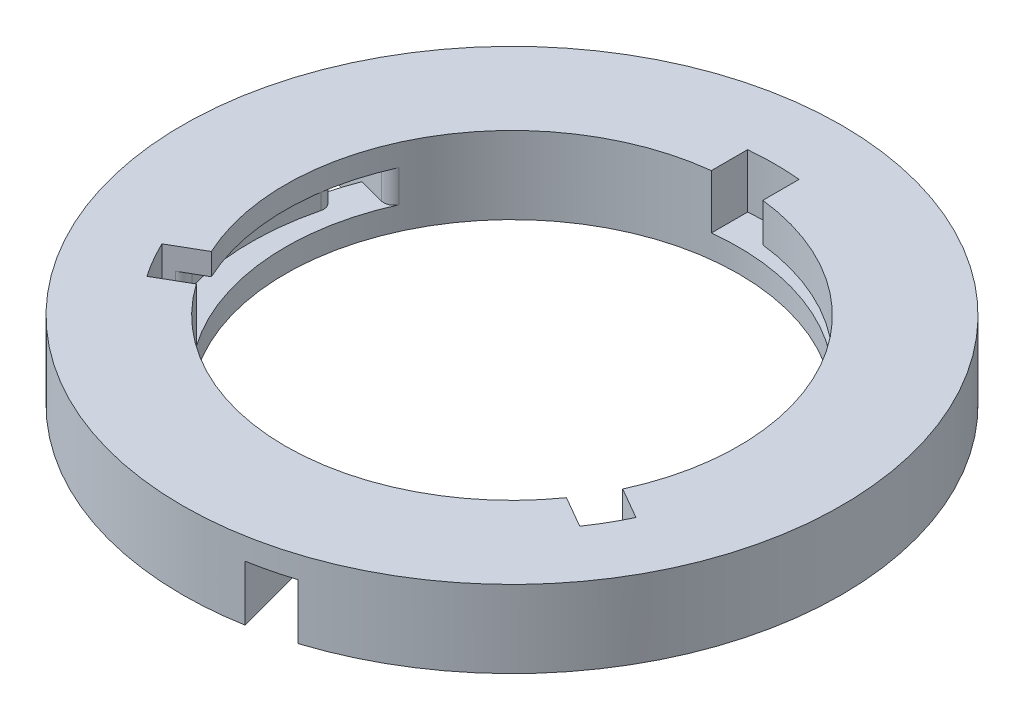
ISO-10303-21;
HEADER;
FILE_DESCRIPTION(('STEP AP214'),'2;1');
FILE_NAME('part.step','',(''),(''),'','','');
FILE_SCHEMA(('AUTOMOTIVE_DESIGN { 1 0 10303 214 1 1 1 1 }'));
ENDSEC;
DATA;
#1=APPLICATION_CONTEXT('core data for automotive mechanical design processes');
#2=APPLICATION_PROTOCOL_DEFINITION('international standard','automotive_design',2000,#1);
#3=PRODUCT_CONTEXT('',#1,'mechanical');
#4=PRODUCT('Part','Part','',(#3));
#5=PRODUCT_RELATED_PRODUCT_CATEGORY('part','',(#4));
#6=PRODUCT_DEFINITION_FORMATION('','',#4);
#7=PRODUCT_DEFINITION_CONTEXT('part definition',#1,'design');
#8=PRODUCT_DEFINITION('design','',#6,#7);
#9=PRODUCT_DEFINITION_SHAPE('','',#8);
#10=(LENGTH_UNIT() NAMED_UNIT(*) SI_UNIT(.MILLI.,.METRE.));
#11=(NAMED_UNIT(*) PLANE_ANGLE_UNIT() SI_UNIT($,.RADIAN.));
#12=(NAMED_UNIT(*) SI_UNIT($,.STERADIAN.) SOLID_ANGLE_UNIT());
#13=UNCERTAINTY_MEASURE_WITH_UNIT(LENGTH_MEASURE(1.E-05),#10,'distance_accuracy_value','');
#14=(GEOMETRIC_REPRESENTATION_CONTEXT(3) GLOBAL_UNCERTAINTY_ASSIGNED_CONTEXT((#13)) GLOBAL_UNIT_ASSIGNED_CONTEXT((#10,
#11,#12)) REPRESENTATION_CONTEXT('',''));
#15=CARTESIAN_POINT('',(0.,0.,0.));
#16=DIRECTION('',(0.,0.,1.));
#17=DIRECTION('',(1.,0.,0.));
#18=AXIS2_PLACEMENT_3D('',#15,#16,#17);
#19=CARTESIAN_POINT('',(0.,40.3076120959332,0.));
#20=DIRECTION('',(0.,1.,0.));
#21=DIRECTION('',(0.,0.,1.));
#22=AXIS2_PLACEMENT_3D('',#19,#20,#21);
#23=CYLINDRICAL_SURFACE('',#22,64.);
#24=CARTESIAN_POINT('',(0.,15.,0.));
#25=DIRECTION('',(0.,1.,0.));
#26=DIRECTION('',(0.,0.,1.));
#27=AXIS2_PLACEMENT_3D('',#24,#25,#26);
#28=CIRCLE('',#27,64.);
#29=CARTESIAN_POINT('',(0.,15.,64.));
#30=VERTEX_POINT('',#29);
#31=EDGE_CURVE('E310',#30,#30,#28,.T.);
#32=ORIENTED_EDGE('',*,*,#31,.F.);
#33=EDGE_LOOP('',(#32));
#34=FACE_BOUND('',#33,.T.);
#35=DIRECTION('',(0.,1.,0.));
#36=VECTOR('',#35,1.);
#37=CARTESIAN_POINT('',(-62.5277560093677,-0.000999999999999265,-13.6484331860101));
#38=LINE('',#37,#36);
#39=CARTESIAN_POINT('',(-62.5277560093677,0.,-13.6484331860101));
#40=VERTEX_POINT('',#39);
#41=CARTESIAN_POINT('',(-62.5277560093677,10.75,-13.6484331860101));
#42=VERTEX_POINT('',#41);
#43=EDGE_CURVE('E285',#40,#42,#38,.T.);
#44=ORIENTED_EDGE('',*,*,#43,.F.);
#45=CARTESIAN_POINT('',(0.,0.,0.));
#46=DIRECTION('',(0.,1.,0.));
#47=DIRECTION('',(0.,0.,1.));
#48=AXIS2_PLACEMENT_3D('',#45,#46,#47);
#49=CIRCLE('',#48,64.);
#50=CARTESIAN_POINT('',(11.1905472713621,0.,63.0140591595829));
#51=VERTEX_POINT('',#50);
#52=EDGE_CURVE('E71',#40,#51,#49,.T.);
#53=ORIENTED_EDGE('',*,*,#52,.T.);
#54=DIRECTION('',(0.,1.,0.));
#55=VECTOR('',#54,1.);
#56=CARTESIAN_POINT('',(11.1905472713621,-0.000999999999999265,63.0140591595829));
#57=LINE('',#56,#55);
#58=CARTESIAN_POINT('',(11.1905472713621,10.75,63.0140591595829));
#59=VERTEX_POINT('',#58);
#60=EDGE_CURVE('E664',#51,#59,#57,.T.);
#61=ORIENTED_EDGE('',*,*,#60,.T.);
#62=CARTESIAN_POINT('',(0.,10.75,0.));
#63=DIRECTION('',(0.,-1.,0.));
#64=DIRECTION('',(0.,0.,-1.));
#65=AXIS2_PLACEMENT_3D('',#62,#63,#64);
#66=CIRCLE('',#65,64.);
#67=CARTESIAN_POINT('',(19.4439881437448,10.75,60.9748417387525));
#68=VERTEX_POINT('',#67);
#69=EDGE_CURVE('E665',#68,#59,#66,.T.);
#70=ORIENTED_EDGE('',*,*,#69,.F.);
#71=DIRECTION('',(0.,1.,0.));
#72=VECTOR('',#71,1.);
#73=CARTESIAN_POINT('',(19.4439881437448,-0.000999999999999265,60.9748417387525));
#74=LINE('',#73,#72);
#75=CARTESIAN_POINT('',(19.4439881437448,0.,60.9748417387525));
#76=VERTEX_POINT('',#75);
#77=EDGE_CURVE('E669',#76,#68,#74,.T.);
#78=ORIENTED_EDGE('',*,*,#77,.F.);
#79=CARTESIAN_POINT('',(-60.1670496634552,0.,-21.8157313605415));
#80=VERTEX_POINT('',#79);
#81=EDGE_CURVE('E304',#76,#80,#49,.T.);
#82=ORIENTED_EDGE('',*,*,#81,.T.);
#83=DIRECTION('',(0.,1.,0.));
#84=VECTOR('',#83,1.);
#85=CARTESIAN_POINT('',(-60.1670496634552,-0.000999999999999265,-21.8157313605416));
#86=LINE('',#85,#84);
#87=CARTESIAN_POINT('',(-60.1670496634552,10.75,-21.8157313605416));
#88=VERTEX_POINT('',#87);
#89=EDGE_CURVE('E63',#80,#88,#86,.T.);
#90=ORIENTED_EDGE('',*,*,#89,.T.);
#91=CARTESIAN_POINT('',(0.,10.75,0.));
#92=DIRECTION('',(0.,-1.,0.));
#93=DIRECTION('',(0.866025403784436,0.,0.500000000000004));
#94=AXIS2_PLACEMENT_3D('',#91,#92,#93);
#95=CIRCLE('',#94,64.);
#96=EDGE_CURVE('E292',#42,#88,#95,.T.);
#97=ORIENTED_EDGE('',*,*,#96,.F.);
#98=EDGE_LOOP('',(#44,#53,#61,#70,#78,#82,#90,#97));
#99=FACE_BOUND('',#98,.T.);
#100=ADVANCED_FACE('F47',(#34,#99),#23,.T.);
#101=CARTESIAN_POINT('',(44.,0.,0.));
#102=DIRECTION('',(0.,1.,0.));
#103=DIRECTION('',(0.,0.,1.));
#104=AXIS2_PLACEMENT_3D('',#101,#102,#103);
#105=PLANE('',#104);
#106=CARTESIAN_POINT('',(0.,0.,0.));
#107=DIRECTION('',(0.,1.,0.));
#108=DIRECTION('',(0.,0.,1.));
#109=AXIS2_PLACEMENT_3D('',#106,#107,#108);
#110=CIRCLE('',#109,44.);
#111=CARTESIAN_POINT('',(0.,0.,44.));
#112=VERTEX_POINT('',#111);
#113=EDGE_CURVE('E305',#112,#112,#110,.T.);
#114=ORIENTED_EDGE('',*,*,#113,.T.);
#115=EDGE_LOOP('',(#114));
#116=FACE_BOUND('',#115,.T.);
#117=DIRECTION('',(0.965925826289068,0.,0.258819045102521));
#118=VECTOR('',#117,1.);
#119=CARTESIAN_POINT('',(-62.5277560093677,0.,-13.6484331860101));
#120=LINE('',#119,#118);
#121=CARTESIAN_POINT('',(-49.9533716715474,0.,-10.2791370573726));
#122=VERTEX_POINT('',#121);
#123=EDGE_CURVE('E283',#40,#122,#120,.T.);
#124=ORIENTED_EDGE('',*,*,#123,.T.);
#125=CARTESIAN_POINT('',(0.,0.,0.));
#126=DIRECTION('',(0.,1.,0.));
#127=DIRECTION('',(0.,0.,1.));
#128=AXIS2_PLACEMENT_3D('',#125,#126,#127);
#129=CIRCLE('',#128,51.);
#130=CARTESIAN_POINT('',(-47.5514113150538,0.,-18.4353812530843));
#131=VERTEX_POINT('',#130);
#132=EDGE_CURVE('E293',#122,#131,#129,.F.);
#133=ORIENTED_EDGE('',*,*,#132,.T.);
#134=DIRECTION('',(-0.965925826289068,0.,-0.258819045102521));
#135=VECTOR('',#134,1.);
#136=CARTESIAN_POINT('',(-47.5514113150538,0.,-18.4353812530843));
#137=LINE('',#136,#135);
#138=EDGE_CURVE('E744',#131,#80,#137,.T.);
#139=ORIENTED_EDGE('',*,*,#138,.T.);
#140=ORIENTED_EDGE('',*,*,#81,.F.);
#141=DIRECTION('',(-0.258819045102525,0.,-0.965925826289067));
#142=VECTOR('',#141,1.);
#143=CARTESIAN_POINT('',(19.4439881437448,0.,60.9748417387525));
#144=LINE('',#143,#142);
#145=CARTESIAN_POINT('',(16.0746920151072,0.,48.4004574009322));
#146=VERTEX_POINT('',#145);
#147=EDGE_CURVE('E671',#76,#146,#144,.T.);
#148=ORIENTED_EDGE('',*,*,#147,.T.);
#149=CARTESIAN_POINT('',(0.,0.,0.));
#150=DIRECTION('',(0.,1.,0.));
#151=DIRECTION('',(0.,0.,1.));
#152=AXIS2_PLACEMENT_3D('',#149,#150,#151);
#153=CIRCLE('',#152,51.);
#154=CARTESIAN_POINT('',(7.81019716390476,0.,50.3984208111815));
#155=VERTEX_POINT('',#154);
#156=EDGE_CURVE('E747',#146,#155,#153,.F.);
#157=ORIENTED_EDGE('',*,*,#156,.T.);
#158=DIRECTION('',(0.258819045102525,0.,0.965925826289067));
#159=VECTOR('',#158,1.);
#160=CARTESIAN_POINT('',(7.81019716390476,0.,50.3984208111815));
#161=LINE('',#160,#159);
#162=EDGE_CURVE('E302',#155,#51,#161,.T.);
#163=ORIENTED_EDGE('',*,*,#162,.T.);
#164=ORIENTED_EDGE('',*,*,#52,.F.);
#165=EDGE_LOOP('',(#124,#133,#139,#140,#148,#157,#163,#164));
#166=FACE_BOUND('',#165,.T.);
#167=ADVANCED_FACE('F300',(#116,#166),#105,.F.);
#168=CARTESIAN_POINT('',(0.,4.5,0.));
#169=DIRECTION('',(0.,1.,0.));
#170=DIRECTION('',(0.,0.,1.));
#171=AXIS2_PLACEMENT_3D('',#168,#169,#170);
#172=CYLINDRICAL_SURFACE('',#171,51.);
#173=DIRECTION('',(0.,1.,0.));
#174=VECTOR('',#173,1.);
#175=CARTESIAN_POINT('',(-49.9533716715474,-0.000999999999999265,-10.2791370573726));
#176=LINE('',#175,#174);
#177=CARTESIAN_POINT('',(-49.9533716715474,4.5,-10.2791370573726));
#178=VERTEX_POINT('',#177);
#179=CARTESIAN_POINT('',(-49.9533716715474,7.5,-10.2791370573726));
#180=VERTEX_POINT('',#179);
#181=EDGE_CURVE('E297',#178,#180,#176,.T.);
#182=ORIENTED_EDGE('',*,*,#181,.T.);
#183=CARTESIAN_POINT('',(0.,7.5,0.));
#184=DIRECTION('',(0.,1.,0.));
#185=DIRECTION('',(0.866025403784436,0.,0.500000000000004));
#186=AXIS2_PLACEMENT_3D('',#183,#184,#185);
#187=CIRCLE('',#186,51.);
#188=CARTESIAN_POINT('',(-46.0312389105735,7.5,21.9573460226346));
#189=VERTEX_POINT('',#188);
#190=EDGE_CURVE('E438',#180,#189,#187,.T.);
#191=ORIENTED_EDGE('',*,*,#190,.T.);
#192=DIRECTION('',(0.,1.,0.));
#193=VECTOR('',#192,1.);
#194=CARTESIAN_POINT('',(-46.0312389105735,4.5,21.9573460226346));
#195=LINE('',#194,#193);
#196=CARTESIAN_POINT('',(-46.0312389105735,15.,21.9573460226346));
#197=VERTEX_POINT('',#196);
#198=EDGE_CURVE('E561',#189,#197,#195,.T.);
#199=ORIENTED_EDGE('',*,*,#198,.T.);
#200=CARTESIAN_POINT('',(0.,15.,0.));
#201=DIRECTION('',(0.,1.,0.));
#202=DIRECTION('',(0.,0.,1.));
#203=AXIS2_PLACEMENT_3D('',#200,#201,#202);
#204=CIRCLE('',#203,51.);
#205=CARTESIAN_POINT('',(-42.0312389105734,15.,28.8855492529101));
#206=VERTEX_POINT('',#205);
#207=EDGE_CURVE('E547',#197,#206,#204,.T.);
#208=ORIENTED_EDGE('',*,*,#207,.T.);
#209=DIRECTION('',(0.,1.,0.));
#210=VECTOR('',#209,1.);
#211=CARTESIAN_POINT('',(-42.0312389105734,4.5,28.8855492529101));
#212=LINE('',#211,#210);
#213=CARTESIAN_POINT('',(-42.0312389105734,4.5,28.8855492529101));
#214=VERTEX_POINT('',#213);
#215=EDGE_CURVE('E558',#214,#206,#212,.T.);
#216=ORIENTED_EDGE('',*,*,#215,.F.);
#217=CARTESIAN_POINT('',(0.,4.5,0.));
#218=DIRECTION('',(0.,1.,0.));
#219=DIRECTION('',(0.,0.,1.));
#220=AXIS2_PLACEMENT_3D('',#217,#218,#219);
#221=CIRCLE('',#220,51.);
#222=EDGE_CURVE('E533',#178,#214,#221,.T.);
#223=ORIENTED_EDGE('',*,*,#222,.F.);
#224=EDGE_LOOP('',(#182,#191,#199,#208,#216,#223));
#225=FACE_BOUND('',#224,.T.);
#226=ADVANCED_FACE('F766',(#225),#172,.F.);
#227=CARTESIAN_POINT('',(0.,4.5,0.));
#228=DIRECTION('',(0.,1.,0.));
#229=DIRECTION('',(0.,0.,1.));
#230=AXIS2_PLACEMENT_3D('',#227,#228,#229);
#231=CYLINDRICAL_SURFACE('',#230,51.);
#232=DIRECTION('',(0.,1.,0.));
#233=VECTOR('',#232,1.);
#234=CARTESIAN_POINT('',(16.0746920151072,-0.000999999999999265,48.4004574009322));
#235=LINE('',#234,#233);
#236=CARTESIAN_POINT('',(16.0746920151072,4.5,48.4004574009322));
#237=VERTEX_POINT('',#236);
#238=CARTESIAN_POINT('',(16.0746920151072,7.5,48.4004574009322));
#239=VERTEX_POINT('',#238);
#240=EDGE_CURVE('E677',#237,#239,#235,.T.);
#241=ORIENTED_EDGE('',*,*,#240,.T.);
#242=CARTESIAN_POINT('',(0.,7.5,0.));
#243=DIRECTION('',(0.,1.,0.));
#244=DIRECTION('',(0.,0.,-1.));
#245=AXIS2_PLACEMENT_3D('',#242,#243,#244);
#246=CIRCLE('',#245,51.);
#247=CARTESIAN_POINT('',(42.0312389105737,7.5,28.8855492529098));
#248=VERTEX_POINT('',#247);
#249=EDGE_CURVE('E427',#239,#248,#246,.T.);
#250=ORIENTED_EDGE('',*,*,#249,.T.);
#251=DIRECTION('',(0.,1.,0.));
#252=VECTOR('',#251,1.);
#253=CARTESIAN_POINT('',(42.0312389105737,4.5,28.8855492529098));
#254=LINE('',#253,#252);
#255=CARTESIAN_POINT('',(42.0312389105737,15.,28.8855492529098));
#256=VERTEX_POINT('',#255);
#257=EDGE_CURVE('E525',#248,#256,#254,.T.);
#258=ORIENTED_EDGE('',*,*,#257,.T.);
#259=CARTESIAN_POINT('',(0.,15.,0.));
#260=DIRECTION('',(0.,1.,0.));
#261=DIRECTION('',(0.866025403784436,0.,-0.500000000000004));
#262=AXIS2_PLACEMENT_3D('',#259,#260,#261);
#263=CIRCLE('',#262,51.);
#264=CARTESIAN_POINT('',(46.0312389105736,15.,21.9573460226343));
#265=VERTEX_POINT('',#264);
#266=EDGE_CURVE('E511',#256,#265,#263,.T.);
#267=ORIENTED_EDGE('',*,*,#266,.T.);
#268=DIRECTION('',(0.,1.,0.));
#269=VECTOR('',#268,1.);
#270=CARTESIAN_POINT('',(46.0312389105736,4.5,21.9573460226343));
#271=LINE('',#270,#269);
#272=CARTESIAN_POINT('',(46.0312389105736,4.5,21.9573460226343));
#273=VERTEX_POINT('',#272);
#274=EDGE_CURVE('E522',#273,#265,#271,.T.);
#275=ORIENTED_EDGE('',*,*,#274,.F.);
#276=CARTESIAN_POINT('',(0.,4.5,0.));
#277=DIRECTION('',(0.,1.,0.));
#278=DIRECTION('',(0.866025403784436,0.,-0.500000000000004));
#279=AXIS2_PLACEMENT_3D('',#276,#277,#278);
#280=CIRCLE('',#279,51.);
#281=EDGE_CURVE('E497',#237,#273,#280,.T.);
#282=ORIENTED_EDGE('',*,*,#281,.F.);
#283=EDGE_LOOP('',(#241,#250,#258,#267,#275,#282));
#284=FACE_BOUND('',#283,.T.);
#285=ADVANCED_FACE('F757',(#284),#231,.F.);
#286=CARTESIAN_POINT('',(0.,40.3076120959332,0.));
#287=DIRECTION('',(0.,1.,0.));
#288=DIRECTION('',(0.,0.,1.));
#289=AXIS2_PLACEMENT_3D('',#286,#287,#288);
#290=CYLINDRICAL_SURFACE('',#289,44.);
#291=ORIENTED_EDGE('',*,*,#113,.F.);
#292=EDGE_LOOP('',(#291));
#293=FACE_BOUND('',#292,.T.);
#294=DIRECTION('',(0.,1.,0.));
#295=VECTOR('',#294,1.);
#296=CARTESIAN_POINT('',(-40.0752837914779,40.3076120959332,-18.1651212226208));
#297=LINE('',#296,#295);
#298=CARTESIAN_POINT('',(-40.0752837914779,10.75,-18.1651212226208));
#299=VERTEX_POINT('',#298);
#300=CARTESIAN_POINT('',(-40.0752837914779,4.5,-18.1651212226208));
#301=VERTEX_POINT('',#300);
#302=EDGE_CURVE('E329',#299,#301,#297,.F.);
#303=ORIENTED_EDGE('',*,*,#302,.T.);
#304=CARTESIAN_POINT('',(0.,4.5,0.));
#305=DIRECTION('',(0.,-1.,0.));
#306=DIRECTION('',(0.,0.,1.));
#307=AXIS2_PLACEMENT_3D('',#304,#305,#306);
#308=CIRCLE('',#307,44.);
#309=CARTESIAN_POINT('',(-35.9473319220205,4.5,25.3730039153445));
#310=VERTEX_POINT('',#309);
#311=EDGE_CURVE('E530',#310,#301,#308,.T.);
#312=ORIENTED_EDGE('',*,*,#311,.F.);
#313=DIRECTION('',(0.,1.,0.));
#314=VECTOR('',#313,1.);
#315=CARTESIAN_POINT('',(-35.9473319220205,4.5,25.3730039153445));
#316=LINE('',#315,#314);
#317=CARTESIAN_POINT('',(-35.9473319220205,15.,25.3730039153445));
#318=VERTEX_POINT('',#317);
#319=EDGE_CURVE('E553',#310,#318,#316,.T.);
#320=ORIENTED_EDGE('',*,*,#319,.T.);
#321=CARTESIAN_POINT('',(0.,15.,0.));
#322=DIRECTION('',(0.,1.,0.));
#323=DIRECTION('',(0.,0.,1.));
#324=AXIS2_PLACEMENT_3D('',#321,#322,#323);
#325=CIRCLE('',#324,44.);
#326=CARTESIAN_POINT('',(35.9473319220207,15.,25.3730039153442));
#327=VERTEX_POINT('',#326);
#328=EDGE_CURVE('E325',#318,#327,#325,.T.);
#329=ORIENTED_EDGE('',*,*,#328,.T.);
#330=DIRECTION('',(0.,1.,0.));
#331=VECTOR('',#330,1.);
#332=CARTESIAN_POINT('',(35.9473319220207,4.5,25.3730039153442));
#333=LINE('',#332,#331);
#334=CARTESIAN_POINT('',(35.9473319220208,10.75,25.3730039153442));
#335=VERTEX_POINT('',#334);
#336=EDGE_CURVE('E507',#335,#327,#333,.T.);
#337=ORIENTED_EDGE('',*,*,#336,.F.);
#338=CARTESIAN_POINT('',(0.,10.75,0.));
#339=DIRECTION('',(0.,-1.,0.));
#340=DIRECTION('',(0.,0.,1.));
#341=AXIS2_PLACEMENT_3D('',#338,#339,#340);
#342=CIRCLE('',#341,44.);
#343=CARTESIAN_POINT('',(14.2593144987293,10.75,41.6253762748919));
#344=VERTEX_POINT('',#343);
#345=EDGE_CURVE('E443',#335,#344,#342,.T.);
#346=ORIENTED_EDGE('',*,*,#345,.T.);
#347=CARTESIAN_POINT('',(0.,10.75,0.));
#348=DIRECTION('',(0.,1.,0.));
#349=DIRECTION('',(0.,0.,-1.));
#350=AXIS2_PLACEMENT_3D('',#347,#348,#349);
#351=CIRCLE('',#350,44.);
#352=CARTESIAN_POINT('',(4.30618545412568,10.75,43.788774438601));
#353=VERTEX_POINT('',#352);
#354=EDGE_CURVE('E435',#353,#344,#351,.T.);
#355=ORIENTED_EDGE('',*,*,#354,.F.);
#356=DIRECTION('',(0.,1.,0.));
#357=VECTOR('',#356,1.);
#358=CARTESIAN_POINT('',(4.30618545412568,40.3076120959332,43.788774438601));
#359=LINE('',#358,#357);
#360=CARTESIAN_POINT('',(4.30618545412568,4.5,43.788774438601));
#361=VERTEX_POINT('',#360);
#362=EDGE_CURVE('E324',#353,#361,#359,.F.);
#363=ORIENTED_EDGE('',*,*,#362,.T.);
#364=CARTESIAN_POINT('',(0.,4.5,0.));
#365=DIRECTION('',(0.,-1.,0.));
#366=DIRECTION('',(0.866025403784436,0.,-0.500000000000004));
#367=AXIS2_PLACEMENT_3D('',#364,#365,#366);
#368=CIRCLE('',#367,44.);
#369=CARTESIAN_POINT('',(39.9473319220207,4.5,18.4448006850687));
#370=VERTEX_POINT('',#369);
#371=EDGE_CURVE('E494',#370,#361,#368,.T.);
#372=ORIENTED_EDGE('',*,*,#371,.F.);
#373=DIRECTION('',(0.,1.,0.));
#374=VECTOR('',#373,1.);
#375=CARTESIAN_POINT('',(39.9473319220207,4.5,18.4448006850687));
#376=LINE('',#375,#374);
#377=CARTESIAN_POINT('',(39.9473319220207,15.,18.4448006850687));
#378=VERTEX_POINT('',#377);
#379=EDGE_CURVE('E517',#370,#378,#376,.T.);
#380=ORIENTED_EDGE('',*,*,#379,.T.);
#381=CARTESIAN_POINT('',(5.,15.,-43.7149859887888));
#382=VERTEX_POINT('',#381);
#383=EDGE_CURVE('E319',#378,#382,#325,.T.);
#384=ORIENTED_EDGE('',*,*,#383,.T.);
#385=DIRECTION('',(0.,1.,0.));
#386=VECTOR('',#385,1.);
#387=CARTESIAN_POINT('',(5.,4.5,-43.7149859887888));
#388=LINE('',#387,#386);
#389=CARTESIAN_POINT('',(5.,7.5,-43.7149859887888));
#390=VERTEX_POINT('',#389);
#391=EDGE_CURVE('E589',#390,#382,#388,.T.);
#392=ORIENTED_EDGE('',*,*,#391,.F.);
#393=CARTESIAN_POINT('',(0.,7.5,0.));
#394=DIRECTION('',(0.,-1.,0.));
#395=DIRECTION('',(0.,0.,1.));
#396=AXIS2_PLACEMENT_3D('',#393,#394,#395);
#397=CIRCLE('',#396,44.);
#398=CARTESIAN_POINT('',(36.2509713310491,7.5,-24.9372628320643));
#399=VERTEX_POINT('',#398);
#400=EDGE_CURVE('E475',#390,#399,#397,.T.);
#401=ORIENTED_EDGE('',*,*,#400,.T.);
#402=DIRECTION('',(0.,-1.,0.));
#403=VECTOR('',#402,1.);
#404=CARTESIAN_POINT('',(36.2509713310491,7.5,-24.9372628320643));
#405=LINE('',#404,#403);
#406=CARTESIAN_POINT('',(36.2509713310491,4.5,-24.9372628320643));
#407=VERTEX_POINT('',#406);
#408=EDGE_CURVE('E489',#399,#407,#405,.T.);
#409=ORIENTED_EDGE('',*,*,#408,.T.);
#410=CARTESIAN_POINT('',(0.,4.5,0.));
#411=DIRECTION('',(0.,-1.,0.));
#412=DIRECTION('',(0.,0.,1.));
#413=AXIS2_PLACEMENT_3D('',#410,#411,#412);
#414=CIRCLE('',#413,44.);
#415=CARTESIAN_POINT('',(-5.,4.5,-43.7149859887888));
#416=VERTEX_POINT('',#415);
#417=EDGE_CURVE('E575',#416,#407,#414,.T.);
#418=ORIENTED_EDGE('',*,*,#417,.F.);
#419=DIRECTION('',(0.,1.,0.));
#420=VECTOR('',#419,1.);
#421=CARTESIAN_POINT('',(-5.,4.5,-43.7149859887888));
#422=LINE('',#421,#420);
#423=CARTESIAN_POINT('',(-5.,15.,-43.7149859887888));
#424=VERTEX_POINT('',#423);
#425=EDGE_CURVE('E592',#416,#424,#422,.T.);
#426=ORIENTED_EDGE('',*,*,#425,.T.);
#427=CARTESIAN_POINT('',(-39.9473319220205,15.,18.4448006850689));
#428=VERTEX_POINT('',#427);
#429=EDGE_CURVE('E320',#424,#428,#325,.T.);
#430=ORIENTED_EDGE('',*,*,#429,.T.);
#431=DIRECTION('',(0.,1.,0.));
#432=VECTOR('',#431,1.);
#433=CARTESIAN_POINT('',(-39.9473319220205,4.5,18.4448006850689));
#434=LINE('',#433,#432);
#435=CARTESIAN_POINT('',(-39.9473319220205,10.75,18.444800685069));
#436=VERTEX_POINT('',#435);
#437=EDGE_CURVE('E543',#436,#428,#434,.T.);
#438=ORIENTED_EDGE('',*,*,#437,.F.);
#439=CARTESIAN_POINT('',(0.,10.75,0.));
#440=DIRECTION('',(0.,-1.,0.));
#441=DIRECTION('',(-0.866025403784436,0.,-0.500000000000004));
#442=AXIS2_PLACEMENT_3D('',#439,#440,#441);
#443=CIRCLE('',#442,44.);
#444=CARTESIAN_POINT('',(-43.178290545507,10.75,-8.46375954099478));
#445=VERTEX_POINT('',#444);
#446=EDGE_CURVE('E699',#436,#445,#443,.T.);
#447=ORIENTED_EDGE('',*,*,#446,.T.);
#448=CARTESIAN_POINT('',(0.,10.75,0.));
#449=DIRECTION('',(0.,1.,0.));
#450=DIRECTION('',(0.866025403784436,0.,0.500000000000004));
#451=AXIS2_PLACEMENT_3D('',#448,#449,#450);
#452=CIRCLE('',#451,44.);
#453=EDGE_CURVE('E689',#299,#445,#452,.T.);
#454=ORIENTED_EDGE('',*,*,#453,.F.);
#455=EDGE_LOOP('',(#303,#312,#320,#329,#337,#346,#355,#363,#372,#380,#384,#392,#401,#409,#418,
#426,#430,#438,#447,#454));
#456=FACE_BOUND('',#455,.T.);
#457=ADVANCED_FACE('F613',(#293,#456),#290,.F.);
#458=CARTESIAN_POINT('',(-46.0312389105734,4.5,21.9573460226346));
#459=DIRECTION('',(-0.500000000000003,0.,-0.866025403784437));
#460=DIRECTION('',(-0.866025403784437,0.,0.500000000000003));
#461=AXIS2_PLACEMENT_3D('',#458,#459,#460);
#462=PLANE('',#461);
#463=DIRECTION('',(0.866025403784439,0.,-0.500000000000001));
#464=VECTOR('',#463,1.);
#465=CARTESIAN_POINT('',(-39.9473319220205,7.5,18.444800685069));
#466=LINE('',#465,#464);
#467=CARTESIAN_POINT('',(-44.3356554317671,7.5,20.9784004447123));
#468=VERTEX_POINT('',#467);
#469=EDGE_CURVE('E430',#189,#468,#466,.T.);
#470=ORIENTED_EDGE('',*,*,#469,.T.);
#471=DIRECTION('',(0.,1.,0.));
#472=VECTOR('',#471,1.);
#473=CARTESIAN_POINT('',(-44.3356554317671,10.75,20.9784004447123));
#474=LINE('',#473,#472);
#475=CARTESIAN_POINT('',(-44.3356554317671,10.75,20.9784004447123));
#476=VERTEX_POINT('',#475);
#477=EDGE_CURVE('E356',#468,#476,#474,.T.);
#478=ORIENTED_EDGE('',*,*,#477,.T.);
#479=DIRECTION('',(0.866025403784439,0.,-0.5));
#480=VECTOR('',#479,1.);
#481=CARTESIAN_POINT('',(-42.9784208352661,10.75,20.194800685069));
#482=LINE('',#481,#480);
#483=EDGE_CURVE('E706',#476,#436,#482,.T.);
#484=ORIENTED_EDGE('',*,*,#483,.T.);
#485=ORIENTED_EDGE('',*,*,#437,.T.);
#486=DIRECTION('',(-0.866025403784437,0.,0.500000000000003));
#487=VECTOR('',#486,1.);
#488=CARTESIAN_POINT('',(-46.0312389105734,15.,21.9573460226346));
#489=LINE('',#488,#487);
#490=EDGE_CURVE('E521',#428,#197,#489,.T.);
#491=ORIENTED_EDGE('',*,*,#490,.T.);
#492=ORIENTED_EDGE('',*,*,#198,.F.);
#493=EDGE_LOOP('',(#470,#478,#484,#485,#491,#492));
#494=FACE_BOUND('',#493,.T.);
#495=ADVANCED_FACE('F795',(#494),#462,.F.);
#496=CARTESIAN_POINT('',(0.,7.5,0.));
#497=DIRECTION('',(0.,-1.,0.));
#498=DIRECTION('',(0.866025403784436,0.,0.500000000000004));
#499=AXIS2_PLACEMENT_3D('',#496,#497,#498);
#500=PLANE('',#499);
#501=DIRECTION('',(-0.965925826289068,0.,-0.258819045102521));
#502=VECTOR('',#501,1.);
#503=CARTESIAN_POINT('',(-43.178290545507,7.5,-8.46375954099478));
#504=LINE('',#503,#502);
#505=CARTESIAN_POINT('',(-45.1141047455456,7.5,-8.98245939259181));
#506=VERTEX_POINT('',#505);
#507=EDGE_CURVE('E684',#506,#180,#504,.T.);
#508=ORIENTED_EDGE('',*,*,#507,.F.);
#509=CARTESIAN_POINT('',(-45.6317428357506,7.5,-7.05060774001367));
#510=DIRECTION('',(0.,-1.,0.));
#511=DIRECTION('',(0.,0.,-1.));
#512=AXIS2_PLACEMENT_3D('',#509,#510,#511);
#513=CIRCLE('',#512,2.);
#514=CARTESIAN_POINT('',(-43.6911716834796,7.5,-6.56668253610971));
#515=VERTEX_POINT('',#514);
#516=EDGE_CURVE('E346',#506,#515,#513,.T.);
#517=ORIENTED_EDGE('',*,*,#516,.T.);
#518=CARTESIAN_POINT('',(4.82310712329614,7.5,5.53144756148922));
#519=DIRECTION('',(0.,1.,0.));
#520=DIRECTION('',(-0.866025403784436,0.,-0.500000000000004));
#521=AXIS2_PLACEMENT_3D('',#518,#519,#520);
#522=CIRCLE('',#521,50.);
#523=CARTESIAN_POINT('',(-43.4064722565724,7.5,18.7188534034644));
#524=VERTEX_POINT('',#523);
#525=EDGE_CURVE('E695',#515,#524,#522,.T.);
#526=ORIENTED_EDGE('',*,*,#525,.T.);
#527=CARTESIAN_POINT('',(-45.3356554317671,7.5,19.2463496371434));
#528=DIRECTION('',(0.,-1.,0.));
#529=DIRECTION('',(0.,0.,-1.));
#530=AXIS2_PLACEMENT_3D('',#527,#528,#529);
#531=CIRCLE('',#530,2.);
#532=EDGE_CURVE('E343',#524,#468,#531,.T.);
#533=ORIENTED_EDGE('',*,*,#532,.T.);
#534=ORIENTED_EDGE('',*,*,#469,.F.);
#535=ORIENTED_EDGE('',*,*,#190,.F.);
#536=EDGE_LOOP('',(#508,#517,#526,#533,#534,#535));
#537=FACE_BOUND('',#536,.T.);
#538=ADVANCED_FACE('F846',(#537),#500,.T.);
#539=CARTESIAN_POINT('',(42.0312389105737,4.5,28.8855492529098));
#540=DIRECTION('',(-0.499999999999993,0.,0.866025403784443));
#541=DIRECTION('',(0.866025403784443,0.,0.499999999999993));
#542=AXIS2_PLACEMENT_3D('',#539,#540,#541);
#543=PLANE('',#542);
#544=DIRECTION('',(-0.866025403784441,0.,-0.499999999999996));
#545=VECTOR('',#544,1.);
#546=CARTESIAN_POINT('',(35.9473319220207,7.5,25.3730039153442));
#547=LINE('',#546,#545);
#548=CARTESIAN_POINT('',(40.3356554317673,7.5,27.9066036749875));
#549=VERTEX_POINT('',#548);
#550=EDGE_CURVE('E459',#248,#549,#547,.T.);
#551=ORIENTED_EDGE('',*,*,#550,.T.);
#552=DIRECTION('',(0.,1.,0.));
#553=VECTOR('',#552,1.);
#554=CARTESIAN_POINT('',(40.3356554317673,10.75,27.9066036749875));
#555=LINE('',#554,#553);
#556=CARTESIAN_POINT('',(40.3356554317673,10.75,27.9066036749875));
#557=VERTEX_POINT('',#556);
#558=EDGE_CURVE('E377',#549,#557,#555,.T.);
#559=ORIENTED_EDGE('',*,*,#558,.T.);
#560=DIRECTION('',(-0.866025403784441,0.,-0.499999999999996));
#561=VECTOR('',#560,1.);
#562=CARTESIAN_POINT('',(38.9784208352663,10.75,27.1230039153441));
#563=LINE('',#562,#561);
#564=EDGE_CURVE('E450',#557,#335,#563,.T.);
#565=ORIENTED_EDGE('',*,*,#564,.T.);
#566=ORIENTED_EDGE('',*,*,#336,.T.);
#567=DIRECTION('',(0.866025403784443,0.,0.499999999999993));
#568=VECTOR('',#567,1.);
#569=CARTESIAN_POINT('',(42.0312389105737,15.,28.8855492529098));
#570=LINE('',#569,#568);
#571=EDGE_CURVE('E493',#327,#256,#570,.T.);
#572=ORIENTED_EDGE('',*,*,#571,.T.);
#573=ORIENTED_EDGE('',*,*,#257,.F.);
#574=EDGE_LOOP('',(#551,#559,#565,#566,#572,#573));
#575=FACE_BOUND('',#574,.T.);
#576=ADVANCED_FACE('F644',(#575),#543,.F.);
#577=CARTESIAN_POINT('',(0.,7.5,0.));
#578=DIRECTION('',(0.,-1.,0.));
#579=DIRECTION('',(0.,0.,-1.));
#580=AXIS2_PLACEMENT_3D('',#577,#578,#579);
#581=PLANE('',#580);
#582=DIRECTION('',(0.258819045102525,0.,0.965925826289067));
#583=VECTOR('',#582,1.);
#584=CARTESIAN_POINT('',(14.2593144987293,7.5,41.6253762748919));
#585=LINE('',#584,#583);
#586=CARTESIAN_POINT('',(14.7780143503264,7.5,43.5611904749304));
#587=VERTEX_POINT('',#586);
#588=EDGE_CURVE('E420',#587,#239,#585,.T.);
#589=ORIENTED_EDGE('',*,*,#588,.F.);
#590=CARTESIAN_POINT('',(16.7098660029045,7.5,43.0435523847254));
#591=DIRECTION('',(0.,-1.,0.));
#592=DIRECTION('',(0.,0.,-1.));
#593=AXIS2_PLACEMENT_3D('',#590,#591,#592);
#594=CIRCLE('',#593,2.);
#595=CARTESIAN_POINT('',(16.1586719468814,7.5,41.1210058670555));
#596=VERTEX_POINT('',#595);
#597=EDGE_CURVE('E367',#587,#596,#594,.T.);
#598=ORIENTED_EDGE('',*,*,#597,.T.);
#599=CARTESIAN_POINT('',(2.37882054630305,7.5,-6.94265707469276));
#600=DIRECTION('',(0.,1.,0.));
#601=DIRECTION('',(0.,0.,1.));
#602=AXIS2_PLACEMENT_3D('',#599,#600,#601);
#603=CIRCLE('',#602,50.);
#604=CARTESIAN_POINT('',(37.9142387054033,7.5,28.2316809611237));
#605=VERTEX_POINT('',#604);
#606=EDGE_CURVE('E447',#596,#605,#603,.T.);
#607=ORIENTED_EDGE('',*,*,#606,.T.);
#608=CARTESIAN_POINT('',(39.3356554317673,7.5,29.6386544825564));
#609=DIRECTION('',(0.,-1.,0.));
#610=DIRECTION('',(0.,0.,-1.));
#611=AXIS2_PLACEMENT_3D('',#608,#609,#610);
#612=CIRCLE('',#611,2.);
#613=EDGE_CURVE('E364',#605,#549,#612,.T.);
#614=ORIENTED_EDGE('',*,*,#613,.T.);
#615=ORIENTED_EDGE('',*,*,#550,.F.);
#616=ORIENTED_EDGE('',*,*,#249,.F.);
#617=EDGE_LOOP('',(#589,#598,#607,#614,#615,#616));
#618=FACE_BOUND('',#617,.T.);
#619=ADVANCED_FACE('F423',(#618),#581,.T.);
#620=CARTESIAN_POINT('',(4.99999999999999,4.5,-50.7543101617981));
#621=DIRECTION('',(1.,0.,0.));
#622=DIRECTION('',(0.,0.,-1.));
#623=AXIS2_PLACEMENT_3D('',#620,#621,#622);
#624=PLANE('',#623);
#625=DIRECTION('',(0.,0.,1.));
#626=VECTOR('',#625,1.);
#627=CARTESIAN_POINT('',(5.,7.5,-43.7149859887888));
#628=LINE('',#627,#626);
#629=CARTESIAN_POINT('',(4.99999999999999,7.5,-50.7543101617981));
#630=VERTEX_POINT('',#629);
#631=EDGE_CURVE('E471',#630,#390,#628,.T.);
#632=ORIENTED_EDGE('',*,*,#631,.T.);
#633=ORIENTED_EDGE('',*,*,#391,.T.);
#634=DIRECTION('',(0.,0.,-1.));
#635=VECTOR('',#634,1.);
#636=CARTESIAN_POINT('',(4.99999999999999,15.,-50.7543101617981));
#637=LINE('',#636,#635);
#638=CARTESIAN_POINT('',(4.99999999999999,15.,-50.7543101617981));
#639=VERTEX_POINT('',#638);
#640=EDGE_CURVE('E571',#382,#639,#637,.T.);
#641=ORIENTED_EDGE('',*,*,#640,.T.);
#642=DIRECTION('',(0.,1.,0.));
#643=VECTOR('',#642,1.);
#644=CARTESIAN_POINT('',(4.99999999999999,4.5,-50.7543101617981));
#645=LINE('',#644,#643);
#646=EDGE_CURVE('E312',#630,#639,#645,.T.);
#647=ORIENTED_EDGE('',*,*,#646,.F.);
#648=EDGE_LOOP('',(#632,#633,#641,#647));
#649=FACE_BOUND('',#648,.T.);
#650=ADVANCED_FACE('F629',(#649),#624,.F.);
#651=CARTESIAN_POINT('',(44.,15.,0.));
#652=DIRECTION('',(0.,-1.,0.));
#653=DIRECTION('',(0.,0.,-1.));
#654=AXIS2_PLACEMENT_3D('',#651,#652,#653);
#655=PLANE('',#654);
#656=ORIENTED_EDGE('',*,*,#383,.F.);
#657=DIRECTION('',(-0.866025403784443,0.,-0.499999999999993));
#658=VECTOR('',#657,1.);
#659=CARTESIAN_POINT('',(46.0312389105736,15.,21.9573460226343));
#660=LINE('',#659,#658);
#661=EDGE_CURVE('E498',#265,#378,#660,.T.);
#662=ORIENTED_EDGE('',*,*,#661,.F.);
#663=ORIENTED_EDGE('',*,*,#266,.F.);
#664=ORIENTED_EDGE('',*,*,#571,.F.);
#665=ORIENTED_EDGE('',*,*,#328,.F.);
#666=DIRECTION('',(0.866025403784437,0.,-0.500000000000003));
#667=VECTOR('',#666,1.);
#668=CARTESIAN_POINT('',(-42.0312389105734,15.,28.8855492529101));
#669=LINE('',#668,#667);
#670=EDGE_CURVE('E534',#206,#318,#669,.T.);
#671=ORIENTED_EDGE('',*,*,#670,.F.);
#672=ORIENTED_EDGE('',*,*,#207,.F.);
#673=ORIENTED_EDGE('',*,*,#490,.F.);
#674=ORIENTED_EDGE('',*,*,#429,.F.);
#675=DIRECTION('',(0.,0.,1.));
#676=VECTOR('',#675,1.);
#677=CARTESIAN_POINT('',(-5.00000000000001,15.,-50.7543101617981));
#678=LINE('',#677,#676);
#679=CARTESIAN_POINT('',(-5.,15.,-50.7543101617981));
#680=VERTEX_POINT('',#679);
#681=EDGE_CURVE('E581',#680,#424,#678,.T.);
#682=ORIENTED_EDGE('',*,*,#681,.F.);
#683=CARTESIAN_POINT('',(0.,15.,0.));
#684=DIRECTION('',(0.,1.,0.));
#685=DIRECTION('',(0.,0.,1.));
#686=AXIS2_PLACEMENT_3D('',#683,#684,#685);
#687=CIRCLE('',#686,51.);
#688=EDGE_CURVE('E557',#639,#680,#687,.T.);
#689=ORIENTED_EDGE('',*,*,#688,.F.);
#690=ORIENTED_EDGE('',*,*,#640,.F.);
#691=EDGE_LOOP('',(#656,#662,#663,#664,#665,#671,#672,#673,#674,#682,#689,#690));
#692=FACE_BOUND('',#691,.T.);
#693=ORIENTED_EDGE('',*,*,#31,.T.);
#694=EDGE_LOOP('',(#693));
#695=FACE_BOUND('',#694,.T.);
#696=ADVANCED_FACE('F606',(#692,#695),#655,.F.);
#697=CARTESIAN_POINT('',(0.,4.5,0.));
#698=DIRECTION('',(0.,1.,0.));
#699=DIRECTION('',(0.,0.,1.));
#700=AXIS2_PLACEMENT_3D('',#697,#698,#699);
#701=CYLINDRICAL_SURFACE('',#700,51.);
#702=ORIENTED_EDGE('',*,*,#688,.T.);
#703=DIRECTION('',(0.,1.,0.));
#704=VECTOR('',#703,1.);
#705=CARTESIAN_POINT('',(-5.00000000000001,4.5,-50.7543101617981));
#706=LINE('',#705,#704);
#707=CARTESIAN_POINT('',(-5.00000000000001,4.5,-50.7543101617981));
#708=VERTEX_POINT('',#707);
#709=EDGE_CURVE('E578',#708,#680,#706,.T.);
#710=ORIENTED_EDGE('',*,*,#709,.F.);
#711=CARTESIAN_POINT('',(0.,4.5,0.));
#712=DIRECTION('',(0.,1.,0.));
#713=DIRECTION('',(0.,0.,1.));
#714=AXIS2_PLACEMENT_3D('',#711,#712,#713);
#715=CIRCLE('',#714,51.);
#716=CARTESIAN_POINT('',(41.2728618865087,4.5,-29.9591533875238));
#717=VERTEX_POINT('',#716);
#718=EDGE_CURVE('E566',#717,#708,#715,.T.);
#719=ORIENTED_EDGE('',*,*,#718,.F.);
#720=DIRECTION('',(0.,-1.,0.));
#721=VECTOR('',#720,1.);
#722=CARTESIAN_POINT('',(41.2728618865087,7.5,-29.9591533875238));
#723=LINE('',#722,#721);
#724=CARTESIAN_POINT('',(41.2728618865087,7.5,-29.9591533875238));
#725=VERTEX_POINT('',#724);
#726=EDGE_CURVE('E482',#725,#717,#723,.T.);
#727=ORIENTED_EDGE('',*,*,#726,.F.);
#728=CARTESIAN_POINT('',(0.,7.5,0.));
#729=DIRECTION('',(0.,1.,0.));
#730=DIRECTION('',(0.,0.,-1.));
#731=AXIS2_PLACEMENT_3D('',#728,#729,#730);
#732=CIRCLE('',#731,51.);
#733=EDGE_CURVE('E467',#725,#630,#732,.T.);
#734=ORIENTED_EDGE('',*,*,#733,.T.);
#735=ORIENTED_EDGE('',*,*,#646,.T.);
#736=EDGE_LOOP('',(#702,#710,#719,#727,#734,#735));
#737=FACE_BOUND('',#736,.T.);
#738=ADVANCED_FACE('F620',(#737),#701,.F.);
#739=CARTESIAN_POINT('',(-5.00000000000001,4.5,-50.7543101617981));
#740=DIRECTION('',(-1.,0.,0.));
#741=DIRECTION('',(0.,0.,1.));
#742=AXIS2_PLACEMENT_3D('',#739,#740,#741);
#743=PLANE('',#742);
#744=ORIENTED_EDGE('',*,*,#681,.T.);
#745=ORIENTED_EDGE('',*,*,#425,.F.);
#746=DIRECTION('',(0.,0.,1.));
#747=VECTOR('',#746,1.);
#748=CARTESIAN_POINT('',(-5.00000000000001,4.5,-50.7543101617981));
#749=LINE('',#748,#747);
#750=EDGE_CURVE('E570',#708,#416,#749,.T.);
#751=ORIENTED_EDGE('',*,*,#750,.F.);
#752=ORIENTED_EDGE('',*,*,#709,.T.);
#753=EDGE_LOOP('',(#744,#745,#751,#752));
#754=FACE_BOUND('',#753,.T.);
#755=ADVANCED_FACE('F600',(#754),#743,.F.);
#756=CARTESIAN_POINT('',(0.,4.5,0.));
#757=DIRECTION('',(0.,1.,0.));
#758=DIRECTION('',(0.,0.,1.));
#759=AXIS2_PLACEMENT_3D('',#756,#757,#758);
#760=PLANE('',#759);
#761=ORIENTED_EDGE('',*,*,#718,.T.);
#762=ORIENTED_EDGE('',*,*,#750,.T.);
#763=ORIENTED_EDGE('',*,*,#417,.T.);
#764=DIRECTION('',(0.707106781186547,0.,-0.707106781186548));
#765=VECTOR('',#764,1.);
#766=CARTESIAN_POINT('',(36.2509713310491,4.5,-24.9372628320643));
#767=LINE('',#766,#765);
#768=EDGE_CURVE('E463',#407,#717,#767,.T.);
#769=ORIENTED_EDGE('',*,*,#768,.T.);
#770=EDGE_LOOP('',(#761,#762,#763,#769));
#771=FACE_BOUND('',#770,.T.);
#772=ADVANCED_FACE('F617',(#771),#760,.T.);
#773=CARTESIAN_POINT('',(-42.0312389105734,4.5,28.8855492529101));
#774=DIRECTION('',(0.500000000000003,0.,0.866025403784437));
#775=DIRECTION('',(0.866025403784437,0.,-0.500000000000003));
#776=AXIS2_PLACEMENT_3D('',#773,#774,#775);
#777=PLANE('',#776);
#778=ORIENTED_EDGE('',*,*,#670,.T.);
#779=ORIENTED_EDGE('',*,*,#319,.F.);
#780=DIRECTION('',(0.866025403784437,0.,-0.500000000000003));
#781=VECTOR('',#780,1.);
#782=CARTESIAN_POINT('',(-42.0312389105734,4.5,28.8855492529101));
#783=LINE('',#782,#781);
#784=EDGE_CURVE('E539',#214,#310,#783,.T.);
#785=ORIENTED_EDGE('',*,*,#784,.F.);
#786=ORIENTED_EDGE('',*,*,#215,.T.);
#787=EDGE_LOOP('',(#778,#779,#785,#786));
#788=FACE_BOUND('',#787,.T.);
#789=ADVANCED_FACE('F768',(#788),#777,.F.);
#790=CARTESIAN_POINT('',(0.,4.5,0.));
#791=DIRECTION('',(0.,1.,0.));
#792=DIRECTION('',(0.,0.,1.));
#793=AXIS2_PLACEMENT_3D('',#790,#791,#792);
#794=PLANE('',#793);
#795=ORIENTED_EDGE('',*,*,#311,.T.);
#796=CARTESIAN_POINT('',(-41.8968876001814,4.5,-18.9908085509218));
#797=DIRECTION('',(0.,1.,0.));
#798=DIRECTION('',(0.,0.,1.));
#799=AXIS2_PLACEMENT_3D('',#796,#797,#798);
#800=CIRCLE('',#799,2.);
#801=CARTESIAN_POINT('',(-42.4145256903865,4.5,-17.0589568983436));
#802=VERTEX_POINT('',#801);
#803=EDGE_CURVE('E381',#301,#802,#800,.F.);
#804=ORIENTED_EDGE('',*,*,#803,.T.);
#805=DIRECTION('',(-0.965925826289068,0.,-0.258819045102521));
#806=VECTOR('',#805,1.);
#807=CARTESIAN_POINT('',(-40.7438873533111,4.5,-16.6113107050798));
#808=LINE('',#807,#806);
#809=CARTESIAN_POINT('',(-47.5514113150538,4.5,-18.4353812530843));
#810=VERTEX_POINT('',#809);
#811=EDGE_CURVE('E710',#802,#810,#808,.T.);
#812=ORIENTED_EDGE('',*,*,#811,.T.);
#813=EDGE_CURVE('E535',#810,#178,#221,.T.);
#814=ORIENTED_EDGE('',*,*,#813,.T.);
#815=ORIENTED_EDGE('',*,*,#222,.T.);
#816=ORIENTED_EDGE('',*,*,#784,.T.);
#817=EDGE_LOOP('',(#795,#804,#812,#814,#815,#816));
#818=FACE_BOUND('',#817,.T.);
#819=ADVANCED_FACE('F720',(#818),#794,.T.);
#820=CARTESIAN_POINT('',(46.0312389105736,4.5,21.9573460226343));
#821=DIRECTION('',(0.499999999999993,0.,-0.866025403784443));
#822=DIRECTION('',(-0.866025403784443,0.,-0.499999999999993));
#823=AXIS2_PLACEMENT_3D('',#820,#821,#822);
#824=PLANE('',#823);
#825=ORIENTED_EDGE('',*,*,#661,.T.);
#826=ORIENTED_EDGE('',*,*,#379,.F.);
#827=DIRECTION('',(-0.866025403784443,0.,-0.499999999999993));
#828=VECTOR('',#827,1.);
#829=CARTESIAN_POINT('',(46.0312389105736,4.5,21.9573460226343));
#830=LINE('',#829,#828);
#831=EDGE_CURVE('E503',#273,#370,#830,.T.);
#832=ORIENTED_EDGE('',*,*,#831,.F.);
#833=ORIENTED_EDGE('',*,*,#274,.T.);
#834=EDGE_LOOP('',(#825,#826,#832,#833));
#835=FACE_BOUND('',#834,.T.);
#836=ADVANCED_FACE('F775',(#835),#824,.F.);
#837=CARTESIAN_POINT('',(0.,4.5,0.));
#838=DIRECTION('',(0.,1.,0.));
#839=DIRECTION('',(0.866025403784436,0.,-0.500000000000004));
#840=AXIS2_PLACEMENT_3D('',#837,#838,#839);
#841=PLANE('',#840);
#842=ORIENTED_EDGE('',*,*,#371,.T.);
#843=CARTESIAN_POINT('',(4.50192115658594,4.5,45.7791732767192));
#844=DIRECTION('',(0.,1.,0.));
#845=DIRECTION('',(0.,0.,1.));
#846=AXIS2_PLACEMENT_3D('',#843,#844,#845);
#847=CIRCLE('',#846,2.);
#848=CARTESIAN_POINT('',(6.43377280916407,4.5,45.2615351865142));
#849=VERTEX_POINT('',#848);
#850=EDGE_CURVE('E388',#361,#849,#847,.F.);
#851=ORIENTED_EDGE('',*,*,#850,.T.);
#852=DIRECTION('',(0.258819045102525,0.,0.965925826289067));
#853=VECTOR('',#852,1.);
#854=CARTESIAN_POINT('',(5.98612661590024,4.5,43.5908968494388));
#855=LINE('',#854,#853);
#856=CARTESIAN_POINT('',(7.81019716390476,4.5,50.3984208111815));
#857=VERTEX_POINT('',#856);
#858=EDGE_CURVE('E454',#849,#857,#855,.T.);
#859=ORIENTED_EDGE('',*,*,#858,.T.);
#860=EDGE_CURVE('E499',#857,#237,#280,.T.);
#861=ORIENTED_EDGE('',*,*,#860,.T.);
#862=ORIENTED_EDGE('',*,*,#281,.T.);
#863=ORIENTED_EDGE('',*,*,#831,.T.);
#864=EDGE_LOOP('',(#842,#851,#859,#861,#862,#863));
#865=FACE_BOUND('',#864,.T.);
#866=ADVANCED_FACE('F656',(#865),#841,.T.);
#867=CARTESIAN_POINT('',(36.2509713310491,7.5,-24.9372628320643));
#868=DIRECTION('',(-0.707106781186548,0.,-0.707106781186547));
#869=DIRECTION('',(-0.707106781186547,0.,0.707106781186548));
#870=AXIS2_PLACEMENT_3D('',#867,#868,#869);
#871=PLANE('',#870);
#872=ORIENTED_EDGE('',*,*,#768,.F.);
#873=ORIENTED_EDGE('',*,*,#408,.F.);
#874=DIRECTION('',(0.707106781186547,0.,-0.707106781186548));
#875=VECTOR('',#874,1.);
#876=CARTESIAN_POINT('',(36.2509713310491,7.5,-24.9372628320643));
#877=LINE('',#876,#875);
#878=EDGE_CURVE('E479',#399,#725,#877,.T.);
#879=ORIENTED_EDGE('',*,*,#878,.T.);
#880=ORIENTED_EDGE('',*,*,#726,.T.);
#881=EDGE_LOOP('',(#872,#873,#879,#880));
#882=FACE_BOUND('',#881,.T.);
#883=ADVANCED_FACE('F835',(#882),#871,.T.);
#884=CARTESIAN_POINT('',(0.,7.5,0.));
#885=DIRECTION('',(0.,-1.,0.));
#886=DIRECTION('',(0.,0.,-1.));
#887=AXIS2_PLACEMENT_3D('',#884,#885,#886);
#888=PLANE('',#887);
#889=ORIENTED_EDGE('',*,*,#733,.F.);
#890=ORIENTED_EDGE('',*,*,#878,.F.);
#891=ORIENTED_EDGE('',*,*,#400,.F.);
#892=ORIENTED_EDGE('',*,*,#631,.F.);
#893=EDGE_LOOP('',(#889,#890,#891,#892));
#894=FACE_BOUND('',#893,.T.);
#895=ADVANCED_FACE('F626',(#894),#888,.T.);
#896=CARTESIAN_POINT('',(5.98612661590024,7.5,43.5908968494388));
#897=DIRECTION('',(0.965925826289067,0.,-0.258819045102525));
#898=DIRECTION('',(-0.258819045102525,0.,-0.965925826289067));
#899=AXIS2_PLACEMENT_3D('',#896,#897,#898);
#900=PLANE('',#899);
#901=ORIENTED_EDGE('',*,*,#858,.F.);
#902=DIRECTION('',(0.,-1.,0.));
#903=VECTOR('',#902,1.);
#904=CARTESIAN_POINT('',(6.43377280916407,10.75,45.2615351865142));
#905=LINE('',#904,#903);
#906=CARTESIAN_POINT('',(6.43377280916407,10.75,45.2615351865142));
#907=VERTEX_POINT('',#906);
#908=EDGE_CURVE('E336',#849,#907,#905,.F.);
#909=ORIENTED_EDGE('',*,*,#908,.T.);
#910=DIRECTION('',(-0.258819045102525,0.,-0.965925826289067));
#911=VECTOR('',#910,1.);
#912=CARTESIAN_POINT('',(5.98612661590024,10.75,43.5908968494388));
#913=LINE('',#912,#911);
#914=EDGE_CURVE('E429',#59,#907,#913,.T.);
#915=ORIENTED_EDGE('',*,*,#914,.F.);
#916=ORIENTED_EDGE('',*,*,#60,.F.);
#917=ORIENTED_EDGE('',*,*,#162,.F.);
#918=DIRECTION('',(0.,1.,0.));
#919=VECTOR('',#918,1.);
#920=CARTESIAN_POINT('',(7.81019716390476,-0.000999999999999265,50.3984208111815));
#921=LINE('',#920,#919);
#922=EDGE_CURVE('E661',#155,#857,#921,.T.);
#923=ORIENTED_EDGE('',*,*,#922,.T.);
#924=EDGE_LOOP('',(#901,#909,#915,#916,#917,#923));
#925=FACE_BOUND('',#924,.T.);
#926=ADVANCED_FACE('F659',(#925),#900,.T.);
#927=CARTESIAN_POINT('',(2.37882054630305,10.75,-6.94265707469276));
#928=DIRECTION('',(0.,-1.,0.));
#929=DIRECTION('',(0.,0.,-1.));
#930=AXIS2_PLACEMENT_3D('',#927,#928,#929);
#931=CYLINDRICAL_SURFACE('',#930,50.);
#932=ORIENTED_EDGE('',*,*,#606,.F.);
#933=DIRECTION('',(0.,-1.,0.));
#934=VECTOR('',#933,1.);
#935=CARTESIAN_POINT('',(16.1586719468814,10.75,41.1210058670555));
#936=LINE('',#935,#934);
#937=CARTESIAN_POINT('',(16.1586719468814,10.75,41.1210058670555));
#938=VERTEX_POINT('',#937);
#939=EDGE_CURVE('E374',#596,#938,#936,.F.);
#940=ORIENTED_EDGE('',*,*,#939,.T.);
#941=CARTESIAN_POINT('',(2.37882054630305,10.75,-6.94265707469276));
#942=DIRECTION('',(0.,1.,0.));
#943=DIRECTION('',(0.,0.,1.));
#944=AXIS2_PLACEMENT_3D('',#941,#942,#943);
#945=CIRCLE('',#944,50.);
#946=CARTESIAN_POINT('',(37.9142387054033,10.75,28.2316809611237));
#947=VERTEX_POINT('',#946);
#948=EDGE_CURVE('E412',#938,#947,#945,.T.);
#949=ORIENTED_EDGE('',*,*,#948,.T.);
#950=DIRECTION('',(0.,-1.,0.));
#951=VECTOR('',#950,1.);
#952=CARTESIAN_POINT('',(37.9142387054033,10.75,28.2316809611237));
#953=LINE('',#952,#951);
#954=EDGE_CURVE('E370',#947,#605,#953,.T.);
#955=ORIENTED_EDGE('',*,*,#954,.T.);
#956=EDGE_LOOP('',(#932,#940,#949,#955));
#957=FACE_BOUND('',#956,.T.);
#958=ADVANCED_FACE('F820',(#957),#931,.F.);
#959=CARTESIAN_POINT('',(0.,10.75,0.));
#960=DIRECTION('',(0.,1.,0.));
#961=DIRECTION('',(0.,0.,1.));
#962=AXIS2_PLACEMENT_3D('',#959,#960,#961);
#963=PLANE('',#962);
#964=ORIENTED_EDGE('',*,*,#345,.F.);
#965=ORIENTED_EDGE('',*,*,#564,.F.);
#966=CARTESIAN_POINT('',(39.3356554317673,10.75,29.6386544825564));
#967=DIRECTION('',(0.,1.,0.));
#968=DIRECTION('',(0.,0.,1.));
#969=AXIS2_PLACEMENT_3D('',#966,#967,#968);
#970=CIRCLE('',#969,2.);
#971=EDGE_CURVE('E11',#557,#947,#970,.T.);
#972=ORIENTED_EDGE('',*,*,#971,.T.);
#973=ORIENTED_EDGE('',*,*,#948,.F.);
#974=CARTESIAN_POINT('',(16.7098660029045,10.75,43.0435523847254));
#975=DIRECTION('',(0.,1.,0.));
#976=DIRECTION('',(0.,0.,1.));
#977=AXIS2_PLACEMENT_3D('',#974,#975,#976);
#978=CIRCLE('',#977,2.);
#979=CARTESIAN_POINT('',(14.7780143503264,10.75,43.5611904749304));
#980=VERTEX_POINT('',#979);
#981=EDGE_CURVE('E56',#938,#980,#978,.T.);
#982=ORIENTED_EDGE('',*,*,#981,.T.);
#983=DIRECTION('',(0.258819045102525,0.,0.965925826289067));
#984=VECTOR('',#983,1.);
#985=CARTESIAN_POINT('',(14.2593144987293,10.75,41.6253762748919));
#986=LINE('',#985,#984);
#987=EDGE_CURVE('E409',#980,#68,#986,.T.);
#988=ORIENTED_EDGE('',*,*,#987,.T.);
#989=ORIENTED_EDGE('',*,*,#69,.T.);
#990=ORIENTED_EDGE('',*,*,#914,.T.);
#991=CARTESIAN_POINT('',(4.50192115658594,10.75,45.7791732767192));
#992=DIRECTION('',(0.,-1.,0.));
#993=DIRECTION('',(0.,0.,-1.));
#994=AXIS2_PLACEMENT_3D('',#991,#992,#993);
#995=CIRCLE('',#994,2.);
#996=EDGE_CURVE('E391',#907,#353,#995,.F.);
#997=ORIENTED_EDGE('',*,*,#996,.T.);
#998=ORIENTED_EDGE('',*,*,#354,.T.);
#999=EDGE_LOOP('',(#964,#965,#972,#973,#982,#988,#989,#990,#997,#998));
#1000=FACE_BOUND('',#999,.T.);
#1001=ADVANCED_FACE('F407',(#1000),#963,.F.);
#1002=CARTESIAN_POINT('',(14.2593144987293,10.75,41.6253762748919));
#1003=DIRECTION('',(0.965925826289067,0.,-0.258819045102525));
#1004=DIRECTION('',(-0.258819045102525,0.,-0.965925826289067));
#1005=AXIS2_PLACEMENT_3D('',#1002,#1003,#1004);
#1006=PLANE('',#1005);
#1007=ORIENTED_EDGE('',*,*,#987,.F.);
#1008=DIRECTION('',(0.,1.,0.));
#1009=VECTOR('',#1008,1.);
#1010=CARTESIAN_POINT('',(14.7780143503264,7.5,43.5611904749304));
#1011=LINE('',#1010,#1009);
#1012=EDGE_CURVE('E360',#980,#587,#1011,.F.);
#1013=ORIENTED_EDGE('',*,*,#1012,.T.);
#1014=ORIENTED_EDGE('',*,*,#588,.T.);
#1015=ORIENTED_EDGE('',*,*,#240,.F.);
#1016=EDGE_CURVE('E678',#146,#237,#235,.T.);
#1017=ORIENTED_EDGE('',*,*,#1016,.F.);
#1018=ORIENTED_EDGE('',*,*,#147,.F.);
#1019=ORIENTED_EDGE('',*,*,#77,.T.);
#1020=EDGE_LOOP('',(#1007,#1013,#1014,#1015,#1017,#1018,#1019));
#1021=FACE_BOUND('',#1020,.T.);
#1022=ADVANCED_FACE('F419',(#1021),#1006,.F.);
#1023=CARTESIAN_POINT('',(-40.7438873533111,7.5,-16.6113107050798));
#1024=DIRECTION('',(-0.258819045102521,0.,0.965925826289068));
#1025=DIRECTION('',(0.965925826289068,0.,0.258819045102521));
#1026=AXIS2_PLACEMENT_3D('',#1023,#1024,#1025);
#1027=PLANE('',#1026);
#1028=ORIENTED_EDGE('',*,*,#811,.F.);
#1029=DIRECTION('',(0.,-1.,0.));
#1030=VECTOR('',#1029,1.);
#1031=CARTESIAN_POINT('',(-42.4145256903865,10.75,-17.0589568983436));
#1032=LINE('',#1031,#1030);
#1033=CARTESIAN_POINT('',(-42.4145256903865,10.75,-17.0589568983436));
#1034=VERTEX_POINT('',#1033);
#1035=EDGE_CURVE('E333',#802,#1034,#1032,.F.);
#1036=ORIENTED_EDGE('',*,*,#1035,.T.);
#1037=DIRECTION('',(0.965925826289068,0.,0.258819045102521));
#1038=VECTOR('',#1037,1.);
#1039=CARTESIAN_POINT('',(-40.7438873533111,10.75,-16.6113107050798));
#1040=LINE('',#1039,#1038);
#1041=EDGE_CURVE('E685',#88,#1034,#1040,.T.);
#1042=ORIENTED_EDGE('',*,*,#1041,.F.);
#1043=ORIENTED_EDGE('',*,*,#89,.F.);
#1044=ORIENTED_EDGE('',*,*,#138,.F.);
#1045=DIRECTION('',(0.,1.,0.));
#1046=VECTOR('',#1045,1.);
#1047=CARTESIAN_POINT('',(-47.5514113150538,-0.000999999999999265,-18.4353812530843));
#1048=LINE('',#1047,#1046);
#1049=EDGE_CURVE('E726',#131,#810,#1048,.T.);
#1050=ORIENTED_EDGE('',*,*,#1049,.T.);
#1051=EDGE_LOOP('',(#1028,#1036,#1042,#1043,#1044,#1050));
#1052=FACE_BOUND('',#1051,.T.);
#1053=ADVANCED_FACE('F724',(#1052),#1027,.T.);
#1054=CARTESIAN_POINT('',(4.82310712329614,10.75,5.53144756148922));
#1055=DIRECTION('',(0.,-1.,0.));
#1056=DIRECTION('',(0.,0.,-1.));
#1057=AXIS2_PLACEMENT_3D('',#1054,#1055,#1056);
#1058=CYLINDRICAL_SURFACE('',#1057,50.);
#1059=ORIENTED_EDGE('',*,*,#525,.F.);
#1060=DIRECTION('',(0.,-1.,0.));
#1061=VECTOR('',#1060,1.);
#1062=CARTESIAN_POINT('',(-43.6911716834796,10.75,-6.56668253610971));
#1063=LINE('',#1062,#1061);
#1064=CARTESIAN_POINT('',(-43.6911716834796,10.75,-6.56668253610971));
#1065=VERTEX_POINT('',#1064);
#1066=EDGE_CURVE('E353',#515,#1065,#1063,.F.);
#1067=ORIENTED_EDGE('',*,*,#1066,.T.);
#1068=CARTESIAN_POINT('',(4.82310712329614,10.75,5.53144756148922));
#1069=DIRECTION('',(0.,1.,0.));
#1070=DIRECTION('',(-0.866025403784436,0.,-0.500000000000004));
#1071=AXIS2_PLACEMENT_3D('',#1068,#1069,#1070);
#1072=CIRCLE('',#1071,50.);
#1073=CARTESIAN_POINT('',(-43.4064722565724,10.75,18.7188534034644));
#1074=VERTEX_POINT('',#1073);
#1075=EDGE_CURVE('E702',#1065,#1074,#1072,.T.);
#1076=ORIENTED_EDGE('',*,*,#1075,.T.);
#1077=DIRECTION('',(0.,-1.,0.));
#1078=VECTOR('',#1077,1.);
#1079=CARTESIAN_POINT('',(-43.4064722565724,10.75,18.7188534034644));
#1080=LINE('',#1079,#1078);
#1081=EDGE_CURVE('E349',#1074,#524,#1080,.T.);
#1082=ORIENTED_EDGE('',*,*,#1081,.T.);
#1083=EDGE_LOOP('',(#1059,#1067,#1076,#1082));
#1084=FACE_BOUND('',#1083,.T.);
#1085=ADVANCED_FACE('F860',(#1084),#1058,.F.);
#1086=CARTESIAN_POINT('',(0.,10.75,0.));
#1087=DIRECTION('',(0.,1.,0.));
#1088=DIRECTION('',(-0.866025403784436,0.,-0.500000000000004));
#1089=AXIS2_PLACEMENT_3D('',#1086,#1087,#1088);
#1090=PLANE('',#1089);
#1091=ORIENTED_EDGE('',*,*,#446,.F.);
#1092=ORIENTED_EDGE('',*,*,#483,.F.);
#1093=CARTESIAN_POINT('',(-45.3356554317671,10.75,19.2463496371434));
#1094=DIRECTION('',(0.,1.,0.));
#1095=DIRECTION('',(0.,0.,1.));
#1096=AXIS2_PLACEMENT_3D('',#1093,#1094,#1095);
#1097=CIRCLE('',#1096,2.);
#1098=EDGE_CURVE('E399',#476,#1074,#1097,.T.);
#1099=ORIENTED_EDGE('',*,*,#1098,.T.);
#1100=ORIENTED_EDGE('',*,*,#1075,.F.);
#1101=CARTESIAN_POINT('',(-45.6317428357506,10.75,-7.05060774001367));
#1102=DIRECTION('',(0.,1.,0.));
#1103=DIRECTION('',(0.,0.,1.));
#1104=AXIS2_PLACEMENT_3D('',#1101,#1102,#1103);
#1105=CIRCLE('',#1104,2.);
#1106=CARTESIAN_POINT('',(-45.1141047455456,10.75,-8.98245939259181));
#1107=VERTEX_POINT('',#1106);
#1108=EDGE_CURVE('E395',#1065,#1107,#1105,.T.);
#1109=ORIENTED_EDGE('',*,*,#1108,.T.);
#1110=DIRECTION('',(-0.965925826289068,0.,-0.258819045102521));
#1111=VECTOR('',#1110,1.);
#1112=CARTESIAN_POINT('',(-43.178290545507,10.75,-8.46375954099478));
#1113=LINE('',#1112,#1111);
#1114=EDGE_CURVE('E692',#1107,#42,#1113,.T.);
#1115=ORIENTED_EDGE('',*,*,#1114,.T.);
#1116=ORIENTED_EDGE('',*,*,#96,.T.);
#1117=ORIENTED_EDGE('',*,*,#1041,.T.);
#1118=CARTESIAN_POINT('',(-41.8968876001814,10.75,-18.9908085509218));
#1119=DIRECTION('',(0.,-1.,0.));
#1120=DIRECTION('',(0.,0.,-1.));
#1121=AXIS2_PLACEMENT_3D('',#1118,#1119,#1120);
#1122=CIRCLE('',#1121,2.);
#1123=EDGE_CURVE('E384',#1034,#299,#1122,.F.);
#1124=ORIENTED_EDGE('',*,*,#1123,.T.);
#1125=ORIENTED_EDGE('',*,*,#453,.T.);
#1126=EDGE_LOOP('',(#1091,#1092,#1099,#1100,#1109,#1115,#1116,#1117,#1124,#1125));
#1127=FACE_BOUND('',#1126,.T.);
#1128=ADVANCED_FACE('F732',(#1127),#1090,.F.);
#1129=CARTESIAN_POINT('',(-43.178290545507,10.75,-8.46375954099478));
#1130=DIRECTION('',(-0.258819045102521,0.,0.965925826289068));
#1131=DIRECTION('',(0.965925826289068,0.,0.258819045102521));
#1132=AXIS2_PLACEMENT_3D('',#1129,#1130,#1131);
#1133=PLANE('',#1132);
#1134=ORIENTED_EDGE('',*,*,#1114,.F.);
#1135=DIRECTION('',(0.,1.,0.));
#1136=VECTOR('',#1135,1.);
#1137=CARTESIAN_POINT('',(-45.1141047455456,7.5,-8.98245939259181));
#1138=LINE('',#1137,#1136);
#1139=EDGE_CURVE('E339',#1107,#506,#1138,.F.);
#1140=ORIENTED_EDGE('',*,*,#1139,.T.);
#1141=ORIENTED_EDGE('',*,*,#507,.T.);
#1142=ORIENTED_EDGE('',*,*,#181,.F.);
#1143=EDGE_CURVE('E288',#122,#178,#176,.T.);
#1144=ORIENTED_EDGE('',*,*,#1143,.F.);
#1145=ORIENTED_EDGE('',*,*,#123,.F.);
#1146=ORIENTED_EDGE('',*,*,#43,.T.);
#1147=EDGE_LOOP('',(#1134,#1140,#1141,#1142,#1144,#1145,#1146));
#1148=FACE_BOUND('',#1147,.T.);
#1149=ADVANCED_FACE('F284',(#1148),#1133,.F.);
#1150=CARTESIAN_POINT('',(-41.8968876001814,40.3076120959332,-18.9908085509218));
#1151=DIRECTION('',(0.,1.,0.));
#1152=DIRECTION('',(0.,0.,1.));
#1153=AXIS2_PLACEMENT_3D('',#1150,#1151,#1152);
#1154=CYLINDRICAL_SURFACE('',#1153,2.);
#1155=ORIENTED_EDGE('',*,*,#1123,.F.);
#1156=ORIENTED_EDGE('',*,*,#1035,.F.);
#1157=ORIENTED_EDGE('',*,*,#803,.F.);
#1158=ORIENTED_EDGE('',*,*,#302,.F.);
#1159=EDGE_LOOP('',(#1155,#1156,#1157,#1158));
#1160=FACE_BOUND('',#1159,.T.);
#1161=ADVANCED_FACE('F729',(#1160),#1154,.T.);
#1162=CARTESIAN_POINT('',(4.50192115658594,40.3076120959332,45.7791732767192));
#1163=DIRECTION('',(0.,1.,0.));
#1164=DIRECTION('',(0.,0.,1.));
#1165=AXIS2_PLACEMENT_3D('',#1162,#1163,#1164);
#1166=CYLINDRICAL_SURFACE('',#1165,2.);
#1167=ORIENTED_EDGE('',*,*,#996,.F.);
#1168=ORIENTED_EDGE('',*,*,#908,.F.);
#1169=ORIENTED_EDGE('',*,*,#850,.F.);
#1170=ORIENTED_EDGE('',*,*,#362,.F.);
#1171=EDGE_LOOP('',(#1167,#1168,#1169,#1170));
#1172=FACE_BOUND('',#1171,.T.);
#1173=ADVANCED_FACE('F653',(#1172),#1166,.T.);
#1174=CARTESIAN_POINT('',(-45.6317428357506,10.75,-7.05060774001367));
#1175=DIRECTION('',(0.,-1.,0.));
#1176=DIRECTION('',(0.,0.,-1.));
#1177=AXIS2_PLACEMENT_3D('',#1174,#1175,#1176);
#1178=CYLINDRICAL_SURFACE('',#1177,2.);
#1179=ORIENTED_EDGE('',*,*,#1108,.F.);
#1180=ORIENTED_EDGE('',*,*,#1066,.F.);
#1181=ORIENTED_EDGE('',*,*,#516,.F.);
#1182=ORIENTED_EDGE('',*,*,#1139,.F.);
#1183=EDGE_LOOP('',(#1179,#1180,#1181,#1182));
#1184=FACE_BOUND('',#1183,.T.);
#1185=ADVANCED_FACE('F801',(#1184),#1178,.T.);
#1186=CARTESIAN_POINT('',(-45.3356554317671,10.75,19.2463496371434));
#1187=DIRECTION('',(0.,-1.,0.));
#1188=DIRECTION('',(0.,0.,-1.));
#1189=AXIS2_PLACEMENT_3D('',#1186,#1187,#1188);
#1190=CYLINDRICAL_SURFACE('',#1189,2.);
#1191=ORIENTED_EDGE('',*,*,#1098,.F.);
#1192=ORIENTED_EDGE('',*,*,#477,.F.);
#1193=ORIENTED_EDGE('',*,*,#532,.F.);
#1194=ORIENTED_EDGE('',*,*,#1081,.F.);
#1195=EDGE_LOOP('',(#1191,#1192,#1193,#1194));
#1196=FACE_BOUND('',#1195,.T.);
#1197=ADVANCED_FACE('F804',(#1196),#1190,.T.);
#1198=CARTESIAN_POINT('',(16.7098660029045,10.75,43.0435523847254));
#1199=DIRECTION('',(0.,-1.,0.));
#1200=DIRECTION('',(0.,0.,-1.));
#1201=AXIS2_PLACEMENT_3D('',#1198,#1199,#1200);
#1202=CYLINDRICAL_SURFACE('',#1201,2.);
#1203=ORIENTED_EDGE('',*,*,#981,.F.);
#1204=ORIENTED_EDGE('',*,*,#939,.F.);
#1205=ORIENTED_EDGE('',*,*,#597,.F.);
#1206=ORIENTED_EDGE('',*,*,#1012,.F.);
#1207=EDGE_LOOP('',(#1203,#1204,#1205,#1206));
#1208=FACE_BOUND('',#1207,.T.);
#1209=ADVANCED_FACE('F415',(#1208),#1202,.T.);
#1210=CARTESIAN_POINT('',(39.3356554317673,10.75,29.6386544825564));
#1211=DIRECTION('',(0.,-1.,0.));
#1212=DIRECTION('',(0.,0.,-1.));
#1213=AXIS2_PLACEMENT_3D('',#1210,#1211,#1212);
#1214=CYLINDRICAL_SURFACE('',#1213,2.);
#1215=ORIENTED_EDGE('',*,*,#971,.F.);
#1216=ORIENTED_EDGE('',*,*,#558,.F.);
#1217=ORIENTED_EDGE('',*,*,#613,.F.);
#1218=ORIENTED_EDGE('',*,*,#954,.F.);
#1219=EDGE_LOOP('',(#1215,#1216,#1217,#1218));
#1220=FACE_BOUND('',#1219,.T.);
#1221=ADVANCED_FACE('F49',(#1220),#1214,.T.);
#1222=CARTESIAN_POINT('',(0.,-0.000999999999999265,0.));
#1223=DIRECTION('',(0.,1.,0.));
#1224=DIRECTION('',(0.,0.,1.));
#1225=AXIS2_PLACEMENT_3D('',#1222,#1223,#1224);
#1226=CYLINDRICAL_SURFACE('',#1225,51.);
#1227=ORIENTED_EDGE('',*,*,#922,.F.);
#1228=ORIENTED_EDGE('',*,*,#156,.F.);
#1229=ORIENTED_EDGE('',*,*,#1016,.T.);
#1230=ORIENTED_EDGE('',*,*,#860,.F.);
#1231=EDGE_LOOP('',(#1227,#1228,#1229,#1230));
#1232=FACE_BOUND('',#1231,.T.);
#1233=ADVANCED_FACE('F754',(#1232),#1226,.T.);
#1234=CARTESIAN_POINT('',(0.,-0.000999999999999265,0.));
#1235=DIRECTION('',(0.,1.,0.));
#1236=DIRECTION('',(0.,0.,1.));
#1237=AXIS2_PLACEMENT_3D('',#1234,#1235,#1236);
#1238=CYLINDRICAL_SURFACE('',#1237,51.);
#1239=ORIENTED_EDGE('',*,*,#1143,.T.);
#1240=ORIENTED_EDGE('',*,*,#813,.F.);
#1241=ORIENTED_EDGE('',*,*,#1049,.F.);
#1242=ORIENTED_EDGE('',*,*,#132,.F.);
#1243=EDGE_LOOP('',(#1239,#1240,#1241,#1242));
#1244=FACE_BOUND('',#1243,.T.);
#1245=ADVANCED_FACE('F816',(#1244),#1238,.T.);
#1246=CLOSED_SHELL('',(#100,#167,#226,#285,#457,#495,#538,#576,#619,#650,#696,#738,#755,#772,
#789,#819,#836,#866,#883,#895,#926,#958,#1001,#1022,#1053,#1085,#1128,#1149,#1161,#1173,#1185,
#1197,#1209,#1221,#1233,#1245));
#1247=MANIFOLD_SOLID_BREP('B2',#1246);
#1248=ADVANCED_BREP_SHAPE_REPRESENTATION('',(#18,#1247),#14);
#1249=SHAPE_DEFINITION_REPRESENTATION(#9,#1248);
ENDSEC;
END-ISO-10303-21;
